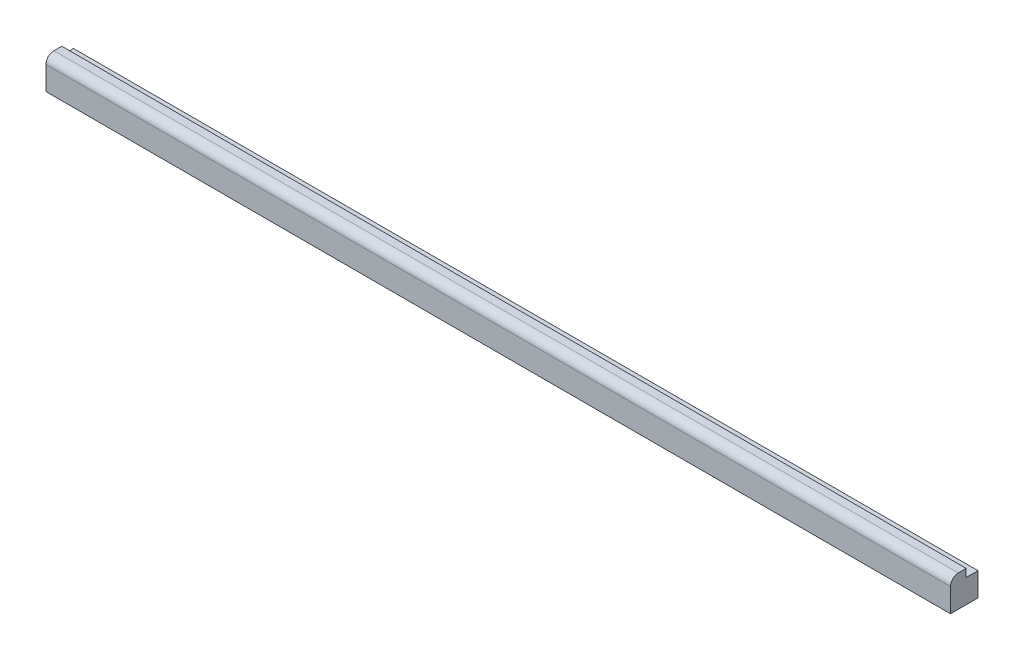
ISO-10303-21;
HEADER;
FILE_DESCRIPTION(('STEP AP214'),'2;1');
FILE_NAME('part.step','',(''),(''),'','','');
FILE_SCHEMA(('AUTOMOTIVE_DESIGN { 1 0 10303 214 1 1 1 1 }'));
ENDSEC;
DATA;
#1=APPLICATION_CONTEXT('core data for automotive mechanical design processes');
#2=APPLICATION_PROTOCOL_DEFINITION('international standard','automotive_design',2000,#1);
#3=PRODUCT_CONTEXT('',#1,'mechanical');
#4=PRODUCT('Part','Part','',(#3));
#5=PRODUCT_RELATED_PRODUCT_CATEGORY('part','',(#4));
#6=PRODUCT_DEFINITION_FORMATION('','',#4);
#7=PRODUCT_DEFINITION_CONTEXT('part definition',#1,'design');
#8=PRODUCT_DEFINITION('design','',#6,#7);
#9=PRODUCT_DEFINITION_SHAPE('','',#8);
#10=(LENGTH_UNIT() NAMED_UNIT(*) SI_UNIT(.MILLI.,.METRE.));
#11=(NAMED_UNIT(*) PLANE_ANGLE_UNIT() SI_UNIT($,.RADIAN.));
#12=(NAMED_UNIT(*) SI_UNIT($,.STERADIAN.) SOLID_ANGLE_UNIT());
#13=UNCERTAINTY_MEASURE_WITH_UNIT(LENGTH_MEASURE(1.E-05),#10,'distance_accuracy_value','');
#14=(GEOMETRIC_REPRESENTATION_CONTEXT(3) GLOBAL_UNCERTAINTY_ASSIGNED_CONTEXT((#13)) GLOBAL_UNIT_ASSIGNED_CONTEXT((#10,
#11,#12)) REPRESENTATION_CONTEXT('',''));
#15=CARTESIAN_POINT('',(0.,0.,0.));
#16=DIRECTION('',(0.,0.,1.));
#17=DIRECTION('',(1.,0.,0.));
#18=AXIS2_PLACEMENT_3D('',#15,#16,#17);
#19=CARTESIAN_POINT('',(365.125,-12.7,-11.1125));
#20=DIRECTION('',(0.,0.,1.));
#21=DIRECTION('',(1.,0.,0.));
#22=AXIS2_PLACEMENT_3D('',#19,#20,#21);
#23=PLANE('',#22);
#24=DIRECTION('',(0.,1.,0.));
#25=VECTOR('',#24,1.);
#26=CARTESIAN_POINT('',(-365.125,-12.7,-11.1125));
#27=LINE('',#26,#25);
#28=CARTESIAN_POINT('',(-365.125,-12.7,-11.1125));
#29=VERTEX_POINT('',#28);
#30=CARTESIAN_POINT('',(-365.125,6.35,-11.1125));
#31=VERTEX_POINT('',#30);
#32=EDGE_CURVE('E111',#29,#31,#27,.T.);
#33=ORIENTED_EDGE('',*,*,#32,.T.);
#34=DIRECTION('',(1.,0.,0.));
#35=VECTOR('',#34,1.);
#36=CARTESIAN_POINT('',(-365.125,6.35,-11.1125));
#37=LINE('',#36,#35);
#38=CARTESIAN_POINT('',(365.125,6.35,-11.1125));
#39=VERTEX_POINT('',#38);
#40=EDGE_CURVE('E116',#31,#39,#37,.T.);
#41=ORIENTED_EDGE('',*,*,#40,.T.);
#42=DIRECTION('',(0.,1.,0.));
#43=VECTOR('',#42,1.);
#44=CARTESIAN_POINT('',(365.125,-12.7,-11.1125));
#45=LINE('',#44,#43);
#46=CARTESIAN_POINT('',(365.125,-12.7,-11.1125));
#47=VERTEX_POINT('',#46);
#48=EDGE_CURVE('E121',#47,#39,#45,.T.);
#49=ORIENTED_EDGE('',*,*,#48,.F.);
#50=DIRECTION('',(-1.,0.,0.));
#51=VECTOR('',#50,1.);
#52=CARTESIAN_POINT('',(365.125,-12.7,-11.1125));
#53=LINE('',#52,#51);
#54=EDGE_CURVE('E122',#47,#29,#53,.T.);
#55=ORIENTED_EDGE('',*,*,#54,.T.);
#56=EDGE_LOOP('',(#33,#41,#49,#55));
#57=FACE_BOUND('',#56,.T.);
#58=ADVANCED_FACE('F33',(#57),#23,.F.);
#59=CARTESIAN_POINT('',(365.125,12.7,11.1125));
#60=DIRECTION('',(0.,-1.,0.));
#61=DIRECTION('',(0.,0.,-1.));
#62=AXIS2_PLACEMENT_3D('',#59,#60,#61);
#63=PLANE('',#62);
#64=DIRECTION('',(0.,0.,1.));
#65=VECTOR('',#64,1.);
#66=CARTESIAN_POINT('',(365.125,12.7,11.1125));
#67=LINE('',#66,#65);
#68=CARTESIAN_POINT('',(365.125,12.7,-1.5875));
#69=VERTEX_POINT('',#68);
#70=CARTESIAN_POINT('',(365.125,12.7,4.7625));
#71=VERTEX_POINT('',#70);
#72=EDGE_CURVE('E55',#69,#71,#67,.T.);
#73=ORIENTED_EDGE('',*,*,#72,.F.);
#74=DIRECTION('',(1.,0.,0.));
#75=VECTOR('',#74,1.);
#76=CARTESIAN_POINT('',(-365.125,12.7,-1.5875));
#77=LINE('',#76,#75);
#78=CARTESIAN_POINT('',(-365.125,12.7,-1.5875));
#79=VERTEX_POINT('',#78);
#80=EDGE_CURVE('E95',#79,#69,#77,.T.);
#81=ORIENTED_EDGE('',*,*,#80,.F.);
#82=DIRECTION('',(0.,0.,1.));
#83=VECTOR('',#82,1.);
#84=CARTESIAN_POINT('',(-365.125,12.7,11.1125));
#85=LINE('',#84,#83);
#86=CARTESIAN_POINT('',(-365.125,12.7,4.7625));
#87=VERTEX_POINT('',#86);
#88=EDGE_CURVE('E103',#79,#87,#85,.T.);
#89=ORIENTED_EDGE('',*,*,#88,.T.);
#90=DIRECTION('',(-1.,0.,0.));
#91=VECTOR('',#90,1.);
#92=CARTESIAN_POINT('',(365.125,12.7,4.7625));
#93=LINE('',#92,#91);
#94=EDGE_CURVE('E41',#87,#71,#93,.F.);
#95=ORIENTED_EDGE('',*,*,#94,.T.);
#96=EDGE_LOOP('',(#73,#81,#89,#95));
#97=FACE_BOUND('',#96,.T.);
#98=ADVANCED_FACE('F102',(#97),#63,.F.);
#99=CARTESIAN_POINT('',(365.125,-12.7,11.1125));
#100=DIRECTION('',(0.,0.,-1.));
#101=DIRECTION('',(-1.,0.,0.));
#102=AXIS2_PLACEMENT_3D('',#99,#100,#101);
#103=PLANE('',#102);
#104=DIRECTION('',(0.,-1.,0.));
#105=VECTOR('',#104,1.);
#106=CARTESIAN_POINT('',(365.125,-12.7,11.1125));
#107=LINE('',#106,#105);
#108=CARTESIAN_POINT('',(365.125,6.35,11.1125));
#109=VERTEX_POINT('',#108);
#110=CARTESIAN_POINT('',(365.125,-12.7,11.1125));
#111=VERTEX_POINT('',#110);
#112=EDGE_CURVE('E138',#109,#111,#107,.T.);
#113=ORIENTED_EDGE('',*,*,#112,.F.);
#114=DIRECTION('',(-1.,0.,0.));
#115=VECTOR('',#114,1.);
#116=CARTESIAN_POINT('',(365.125,6.35,11.1125));
#117=LINE('',#116,#115);
#118=CARTESIAN_POINT('',(-365.125,6.35,11.1125));
#119=VERTEX_POINT('',#118);
#120=EDGE_CURVE('E129',#109,#119,#117,.T.);
#121=ORIENTED_EDGE('',*,*,#120,.T.);
#122=DIRECTION('',(0.,-1.,0.));
#123=VECTOR('',#122,1.);
#124=CARTESIAN_POINT('',(-365.125,-12.7,11.1125));
#125=LINE('',#124,#123);
#126=CARTESIAN_POINT('',(-365.125,-12.7,11.1125));
#127=VERTEX_POINT('',#126);
#128=EDGE_CURVE('E110',#119,#127,#125,.T.);
#129=ORIENTED_EDGE('',*,*,#128,.T.);
#130=DIRECTION('',(-1.,0.,0.));
#131=VECTOR('',#130,1.);
#132=CARTESIAN_POINT('',(365.125,-12.7,11.1125));
#133=LINE('',#132,#131);
#134=EDGE_CURVE('E125',#111,#127,#133,.T.);
#135=ORIENTED_EDGE('',*,*,#134,.F.);
#136=EDGE_LOOP('',(#113,#121,#129,#135));
#137=FACE_BOUND('',#136,.T.);
#138=ADVANCED_FACE('F141',(#137),#103,.F.);
#139=CARTESIAN_POINT('',(365.125,-12.7,11.1125));
#140=DIRECTION('',(0.,1.,0.));
#141=DIRECTION('',(0.,0.,1.));
#142=AXIS2_PLACEMENT_3D('',#139,#140,#141);
#143=PLANE('',#142);
#144=DIRECTION('',(0.,0.,-1.));
#145=VECTOR('',#144,1.);
#146=CARTESIAN_POINT('',(-365.125,-12.7,11.1125));
#147=LINE('',#146,#145);
#148=EDGE_CURVE('E113',#127,#29,#147,.T.);
#149=ORIENTED_EDGE('',*,*,#148,.T.);
#150=ORIENTED_EDGE('',*,*,#54,.F.);
#151=DIRECTION('',(0.,0.,-1.));
#152=VECTOR('',#151,1.);
#153=CARTESIAN_POINT('',(365.125,-12.7,11.1125));
#154=LINE('',#153,#152);
#155=EDGE_CURVE('E126',#111,#47,#154,.T.);
#156=ORIENTED_EDGE('',*,*,#155,.F.);
#157=ORIENTED_EDGE('',*,*,#134,.T.);
#158=EDGE_LOOP('',(#149,#150,#156,#157));
#159=FACE_BOUND('',#158,.T.);
#160=ADVANCED_FACE('F159',(#159),#143,.F.);
#161=CARTESIAN_POINT('',(365.125,0.,0.));
#162=DIRECTION('',(-1.,0.,0.));
#163=DIRECTION('',(0.,0.,1.));
#164=AXIS2_PLACEMENT_3D('',#161,#162,#163);
#165=PLANE('',#164);
#166=ORIENTED_EDGE('',*,*,#48,.T.);
#167=DIRECTION('',(0.,0.,-1.));
#168=VECTOR('',#167,1.);
#169=CARTESIAN_POINT('',(365.125,6.35,-11.1125));
#170=LINE('',#169,#168);
#171=CARTESIAN_POINT('',(365.125,6.35,-1.5875));
#172=VERTEX_POINT('',#171);
#173=EDGE_CURVE('E99',#172,#39,#170,.T.);
#174=ORIENTED_EDGE('',*,*,#173,.F.);
#175=DIRECTION('',(0.,-1.,0.));
#176=VECTOR('',#175,1.);
#177=CARTESIAN_POINT('',(365.125,12.7,-1.5875));
#178=LINE('',#177,#176);
#179=EDGE_CURVE('E151',#69,#172,#178,.T.);
#180=ORIENTED_EDGE('',*,*,#179,.F.);
#181=ORIENTED_EDGE('',*,*,#72,.T.);
#182=CARTESIAN_POINT('',(365.125,6.35,4.7625));
#183=DIRECTION('',(-1.,0.,0.));
#184=DIRECTION('',(0.,0.,1.));
#185=AXIS2_PLACEMENT_3D('',#182,#183,#184);
#186=CIRCLE('',#185,6.35);
#187=EDGE_CURVE('E11',#71,#109,#186,.F.);
#188=ORIENTED_EDGE('',*,*,#187,.T.);
#189=ORIENTED_EDGE('',*,*,#112,.T.);
#190=ORIENTED_EDGE('',*,*,#155,.T.);
#191=EDGE_LOOP('',(#166,#174,#180,#181,#188,#189,#190));
#192=FACE_BOUND('',#191,.T.);
#193=ADVANCED_FACE('F137',(#192),#165,.F.);
#194=CARTESIAN_POINT('',(-365.125,0.,0.));
#195=DIRECTION('',(-1.,0.,0.));
#196=DIRECTION('',(0.,0.,1.));
#197=AXIS2_PLACEMENT_3D('',#194,#195,#196);
#198=PLANE('',#197);
#199=DIRECTION('',(0.,0.,-1.));
#200=VECTOR('',#199,1.);
#201=CARTESIAN_POINT('',(-365.125,6.35,-11.1125));
#202=LINE('',#201,#200);
#203=CARTESIAN_POINT('',(-365.125,6.35,-1.5875));
#204=VERTEX_POINT('',#203);
#205=EDGE_CURVE('E48',#204,#31,#202,.T.);
#206=ORIENTED_EDGE('',*,*,#205,.T.);
#207=ORIENTED_EDGE('',*,*,#32,.F.);
#208=ORIENTED_EDGE('',*,*,#148,.F.);
#209=ORIENTED_EDGE('',*,*,#128,.F.);
#210=CARTESIAN_POINT('',(-365.125,6.35,4.7625));
#211=DIRECTION('',(-1.,0.,0.));
#212=DIRECTION('',(0.,0.,1.));
#213=AXIS2_PLACEMENT_3D('',#210,#211,#212);
#214=CIRCLE('',#213,6.35);
#215=EDGE_CURVE('E108',#119,#87,#214,.T.);
#216=ORIENTED_EDGE('',*,*,#215,.T.);
#217=ORIENTED_EDGE('',*,*,#88,.F.);
#218=DIRECTION('',(0.,-1.,0.));
#219=VECTOR('',#218,1.);
#220=CARTESIAN_POINT('',(-365.125,12.7,-1.5875));
#221=LINE('',#220,#219);
#222=EDGE_CURVE('E91',#79,#204,#221,.T.);
#223=ORIENTED_EDGE('',*,*,#222,.T.);
#224=EDGE_LOOP('',(#206,#207,#208,#209,#216,#217,#223));
#225=FACE_BOUND('',#224,.T.);
#226=ADVANCED_FACE('F106',(#225),#198,.T.);
#227=CARTESIAN_POINT('',(365.125,6.35,4.7625));
#228=DIRECTION('',(-1.,0.,0.));
#229=DIRECTION('',(0.,0.,1.));
#230=AXIS2_PLACEMENT_3D('',#227,#228,#229);
#231=CYLINDRICAL_SURFACE('',#230,6.35);
#232=ORIENTED_EDGE('',*,*,#187,.F.);
#233=ORIENTED_EDGE('',*,*,#94,.F.);
#234=ORIENTED_EDGE('',*,*,#215,.F.);
#235=ORIENTED_EDGE('',*,*,#120,.F.);
#236=EDGE_LOOP('',(#232,#233,#234,#235));
#237=FACE_BOUND('',#236,.T.);
#238=ADVANCED_FACE('F35',(#237),#231,.T.);
#239=CARTESIAN_POINT('',(-365.125,6.35,-11.1125));
#240=DIRECTION('',(0.,-1.,0.));
#241=DIRECTION('',(0.,0.,-1.));
#242=AXIS2_PLACEMENT_3D('',#239,#240,#241);
#243=PLANE('',#242);
#244=ORIENTED_EDGE('',*,*,#173,.T.);
#245=ORIENTED_EDGE('',*,*,#40,.F.);
#246=ORIENTED_EDGE('',*,*,#205,.F.);
#247=DIRECTION('',(1.,0.,0.));
#248=VECTOR('',#247,1.);
#249=CARTESIAN_POINT('',(-365.125,6.35,-1.5875));
#250=LINE('',#249,#248);
#251=EDGE_CURVE('E96',#204,#172,#250,.T.);
#252=ORIENTED_EDGE('',*,*,#251,.T.);
#253=EDGE_LOOP('',(#244,#245,#246,#252));
#254=FACE_BOUND('',#253,.T.);
#255=ADVANCED_FACE('F161',(#254),#243,.F.);
#256=CARTESIAN_POINT('',(-365.125,12.7,-1.5875));
#257=DIRECTION('',(0.,0.,1.));
#258=DIRECTION('',(1.,0.,0.));
#259=AXIS2_PLACEMENT_3D('',#256,#257,#258);
#260=PLANE('',#259);
#261=ORIENTED_EDGE('',*,*,#179,.T.);
#262=ORIENTED_EDGE('',*,*,#251,.F.);
#263=ORIENTED_EDGE('',*,*,#222,.F.);
#264=ORIENTED_EDGE('',*,*,#80,.T.);
#265=EDGE_LOOP('',(#261,#262,#263,#264));
#266=FACE_BOUND('',#265,.T.);
#267=ADVANCED_FACE('F94',(#266),#260,.F.);
#268=CLOSED_SHELL('',(#58,#98,#138,#160,#193,#226,#238,#255,#267));
#269=MANIFOLD_SOLID_BREP('B2',#268);
#270=ADVANCED_BREP_SHAPE_REPRESENTATION('',(#18,#269),#14);
#271=SHAPE_DEFINITION_REPRESENTATION(#9,#270);
ENDSEC;
END-ISO-10303-21;
